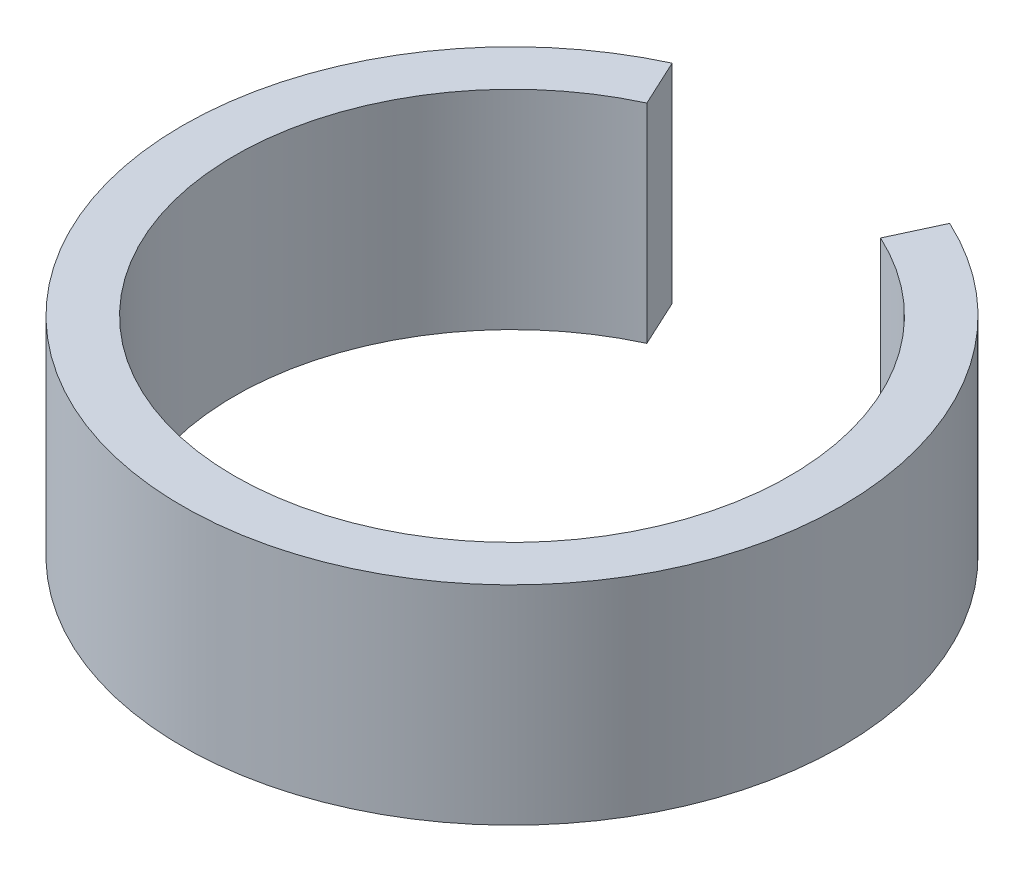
from build123d import *

# Parameters (mm, degrees)
BOSS_EXTRUDE1_DEPTH = 3


with BuildPart() as part:
    # Sketch1 → Boss-Extrude1 (new body)
    with BuildSketch(Plane(origin=(0, 0, 0), x_dir=(1, 0, 0), z_dir=(0, 1, 0))):
        with BuildLine():
            Line((2, 4.308421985), (1.684210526, 3.628144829))
            ThreePointArc((1.684210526, 3.628144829), (0, -4), (-1.684210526, 3.628144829))
            Line((-1.684210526, 3.628144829), (-2, 4.308421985))
            ThreePointArc((-2, 4.308421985), (0, -4.75), (2, 4.308421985))
        make_face()
    extrude(amount=BOSS_EXTRUDE1_DEPTH)


solid = part.part
